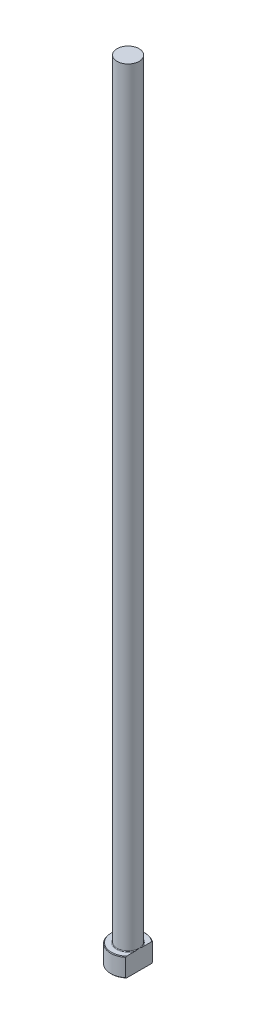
ISO-10303-21;
HEADER;
FILE_DESCRIPTION(('STEP AP214'),'2;1');
FILE_NAME('part.step','',(''),(''),'','','');
FILE_SCHEMA(('AUTOMOTIVE_DESIGN { 1 0 10303 214 1 1 1 1 }'));
ENDSEC;
DATA;
#1=APPLICATION_CONTEXT('core data for automotive mechanical design processes');
#2=APPLICATION_PROTOCOL_DEFINITION('international standard','automotive_design',2000,#1);
#3=PRODUCT_CONTEXT('',#1,'mechanical');
#4=PRODUCT('Part','Part','',(#3));
#5=PRODUCT_RELATED_PRODUCT_CATEGORY('part','',(#4));
#6=PRODUCT_DEFINITION_FORMATION('','',#4);
#7=PRODUCT_DEFINITION_CONTEXT('part definition',#1,'design');
#8=PRODUCT_DEFINITION('design','',#6,#7);
#9=PRODUCT_DEFINITION_SHAPE('','',#8);
#10=(LENGTH_UNIT() NAMED_UNIT(*) SI_UNIT(.MILLI.,.METRE.));
#11=(NAMED_UNIT(*) PLANE_ANGLE_UNIT() SI_UNIT($,.RADIAN.));
#12=(NAMED_UNIT(*) SI_UNIT($,.STERADIAN.) SOLID_ANGLE_UNIT());
#13=UNCERTAINTY_MEASURE_WITH_UNIT(LENGTH_MEASURE(1.E-05),#10,'distance_accuracy_value','');
#14=(GEOMETRIC_REPRESENTATION_CONTEXT(3) GLOBAL_UNCERTAINTY_ASSIGNED_CONTEXT((#13)) GLOBAL_UNIT_ASSIGNED_CONTEXT((#10,
#11,#12)) REPRESENTATION_CONTEXT('',''));
#15=CARTESIAN_POINT('',(0.,0.,0.));
#16=DIRECTION('',(0.,0.,1.));
#17=DIRECTION('',(1.,0.,0.));
#18=AXIS2_PLACEMENT_3D('',#15,#16,#17);
#19=CARTESIAN_POINT('',(0.,0.,0.));
#20=DIRECTION('',(0.,-1.,0.));
#21=DIRECTION('',(0.,0.,-1.));
#22=AXIS2_PLACEMENT_3D('',#19,#20,#21);
#23=PLANE('',#22);
#24=CARTESIAN_POINT('',(0.,0.,0.));
#25=DIRECTION('',(0.,-1.,0.));
#26=DIRECTION('',(0.,0.,-1.));
#27=AXIS2_PLACEMENT_3D('',#24,#25,#26);
#28=CIRCLE('',#27,5.3);
#29=CARTESIAN_POINT('',(3.49999999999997,0.,3.9799497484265));
#30=VERTEX_POINT('',#29);
#31=CARTESIAN_POINT('',(3.49999999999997,0.,-3.9799497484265));
#32=VERTEX_POINT('',#31);
#33=EDGE_CURVE('E98',#30,#32,#28,.T.);
#34=ORIENTED_EDGE('',*,*,#33,.T.);
#35=DIRECTION('',(0.,0.,1.));
#36=VECTOR('',#35,1.);
#37=CARTESIAN_POINT('',(3.49999999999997,0.,4.24264068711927));
#38=LINE('',#37,#36);
#39=EDGE_CURVE('E83',#32,#30,#38,.T.);
#40=ORIENTED_EDGE('',*,*,#39,.T.);
#41=EDGE_LOOP('',(#34,#40));
#42=FACE_BOUND('',#41,.T.);
#43=ADVANCED_FACE('F32',(#42),#23,.T.);
#44=CARTESIAN_POINT('',(0.,259.958771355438,0.));
#45=DIRECTION('',(0.,1.,0.));
#46=DIRECTION('',(0.,0.,1.));
#47=AXIS2_PLACEMENT_3D('',#44,#45,#46);
#48=CYLINDRICAL_SURFACE('',#47,5.49999999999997);
#49=CARTESIAN_POINT('',(0.,5.80000000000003,0.));
#50=DIRECTION('',(0.,1.,0.));
#51=DIRECTION('',(0.,0.,1.));
#52=AXIS2_PLACEMENT_3D('',#49,#50,#51);
#53=CIRCLE('',#52,5.49999999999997);
#54=CARTESIAN_POINT('',(3.49999999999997,5.80000000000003,4.24264068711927));
#55=VERTEX_POINT('',#54);
#56=CARTESIAN_POINT('',(3.49999999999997,5.80000000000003,-4.24264068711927));
#57=VERTEX_POINT('',#56);
#58=EDGE_CURVE('E104',#55,#57,#53,.F.);
#59=ORIENTED_EDGE('',*,*,#58,.T.);
#60=DIRECTION('',(0.,-1.,0.));
#61=VECTOR('',#60,1.);
#62=CARTESIAN_POINT('',(3.49999999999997,250.,-4.24264068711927));
#63=LINE('',#62,#61);
#64=CARTESIAN_POINT('',(3.49999999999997,0.199999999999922,-4.24264068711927));
#65=VERTEX_POINT('',#64);
#66=EDGE_CURVE('E183',#57,#65,#63,.T.);
#67=ORIENTED_EDGE('',*,*,#66,.T.);
#68=CARTESIAN_POINT('',(0.,0.199999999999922,0.));
#69=DIRECTION('',(0.,-1.,0.));
#70=DIRECTION('',(0.,0.,-1.));
#71=AXIS2_PLACEMENT_3D('',#68,#69,#70);
#72=CIRCLE('',#71,5.49999999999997);
#73=CARTESIAN_POINT('',(3.49999999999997,0.199999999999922,4.24264068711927));
#74=VERTEX_POINT('',#73);
#75=EDGE_CURVE('E100',#65,#74,#72,.F.);
#76=ORIENTED_EDGE('',*,*,#75,.T.);
#77=DIRECTION('',(0.,-1.,0.));
#78=VECTOR('',#77,1.);
#79=CARTESIAN_POINT('',(3.49999999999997,250.,4.24264068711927));
#80=LINE('',#79,#78);
#81=EDGE_CURVE('E93',#55,#74,#80,.T.);
#82=ORIENTED_EDGE('',*,*,#81,.F.);
#83=EDGE_LOOP('',(#59,#67,#76,#82));
#84=FACE_BOUND('',#83,.T.);
#85=ADVANCED_FACE('F158',(#84),#48,.T.);
#86=CARTESIAN_POINT('',(-5.49999999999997,6.,0.));
#87=DIRECTION('',(0.,1.,0.));
#88=DIRECTION('',(0.,0.,1.));
#89=AXIS2_PLACEMENT_3D('',#86,#87,#88);
#90=PLANE('',#89);
#91=CARTESIAN_POINT('',(0.,6.,0.));
#92=DIRECTION('',(0.,1.,0.));
#93=DIRECTION('',(0.,0.,1.));
#94=AXIS2_PLACEMENT_3D('',#91,#92,#93);
#95=CIRCLE('',#94,5.29999999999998);
#96=CARTESIAN_POINT('',(3.49999999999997,6.,-3.97994974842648));
#97=VERTEX_POINT('',#96);
#98=CARTESIAN_POINT('',(3.49999999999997,6.,3.97994974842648));
#99=VERTEX_POINT('',#98);
#100=EDGE_CURVE('E178',#97,#99,#95,.T.);
#101=ORIENTED_EDGE('',*,*,#100,.T.);
#102=DIRECTION('',(0.,0.,-1.));
#103=VECTOR('',#102,1.);
#104=CARTESIAN_POINT('',(3.49999999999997,6.,0.));
#105=LINE('',#104,#103);
#106=CARTESIAN_POINT('',(3.49999999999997,5.99999999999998,1.19999999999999));
#107=VERTEX_POINT('',#106);
#108=EDGE_CURVE('E57',#99,#107,#105,.T.);
#109=ORIENTED_EDGE('',*,*,#108,.T.);
#110=CARTESIAN_POINT('',(0.,6.,0.));
#111=DIRECTION('',(0.,1.,0.));
#112=DIRECTION('',(0.,0.,1.));
#113=AXIS2_PLACEMENT_3D('',#110,#111,#112);
#114=CIRCLE('',#113,3.69999999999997);
#115=CARTESIAN_POINT('',(3.49999999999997,5.99999999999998,-1.2));
#116=VERTEX_POINT('',#115);
#117=EDGE_CURVE('E107',#107,#116,#114,.F.);
#118=ORIENTED_EDGE('',*,*,#117,.T.);
#119=EDGE_CURVE('E136',#116,#97,#105,.T.);
#120=ORIENTED_EDGE('',*,*,#119,.T.);
#121=EDGE_LOOP('',(#101,#109,#118,#120));
#122=FACE_BOUND('',#121,.T.);
#123=ADVANCED_FACE('F147',(#122),#90,.T.);
#124=CARTESIAN_POINT('',(0.,6.00000000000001,0.));
#125=DIRECTION('',(0.,-1.,0.));
#126=DIRECTION('',(0.,0.,-1.));
#127=AXIS2_PLACEMENT_3D('',#124,#125,#126);
#128=CONICAL_SURFACE('',#127,5.29999999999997,0.785398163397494);
#129=ORIENTED_EDGE('',*,*,#58,.F.);
#130=CARTESIAN_POINT('',(3.49999999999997,1.33003849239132,9.33542352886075));
#131=CARTESIAN_POINT('',(3.49999999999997,1.46606755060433,9.19014587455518));
#132=CARTESIAN_POINT('',(3.49999999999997,1.60189091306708,9.04467563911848));
#133=CARTESIAN_POINT('',(3.49999999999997,1.87305939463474,8.75328845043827));
#134=CARTESIAN_POINT('',(3.49999999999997,2.00840451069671,8.60737149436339));
#135=CARTESIAN_POINT('',(3.49999999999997,2.41368868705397,8.16878624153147));
#136=CARTESIAN_POINT('',(3.49999999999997,2.68280695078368,7.87535778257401));
#137=CARTESIAN_POINT('',(3.49999999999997,3.22029202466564,7.28335275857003));
#138=CARTESIAN_POINT('',(3.49999999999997,3.4886340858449,6.9847536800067));
#139=CARTESIAN_POINT('',(3.49999999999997,4.02101445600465,6.38381794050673));
#140=CARTESIAN_POINT('',(3.49999999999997,4.28505346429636,6.08148190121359));
#141=CARTESIAN_POINT('',(3.49999999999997,4.76064644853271,5.52540485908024));
#142=CARTESIAN_POINT('',(3.49999999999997,4.97321621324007,5.27253724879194));
#143=CARTESIAN_POINT('',(3.49999999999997,5.28746532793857,4.88936279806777));
#144=CARTESIAN_POINT('',(3.49999999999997,5.39146981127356,4.76096380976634));
#145=CARTESIAN_POINT('',(3.49999999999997,5.59756866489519,4.50264388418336));
#146=CARTESIAN_POINT('',(3.49999999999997,5.69966308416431,4.3727229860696));
#147=CARTESIAN_POINT('',(3.49999999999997,5.9012900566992,4.11132273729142));
#148=CARTESIAN_POINT('',(3.49999999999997,6.00082737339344,3.97984706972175));
#149=CARTESIAN_POINT('',(3.49999999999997,6.19694716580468,3.71471559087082));
#150=CARTESIAN_POINT('',(3.49999999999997,6.29352983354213,3.58105992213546));
#151=CARTESIAN_POINT('',(3.49999999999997,6.48287386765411,3.31118530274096));
#152=CARTESIAN_POINT('',(3.49999999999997,6.57563763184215,3.17496804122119));
#153=CARTESIAN_POINT('',(3.49999999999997,6.75628267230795,2.89934683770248));
#154=CARTESIAN_POINT('',(3.49999999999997,6.84416488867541,2.75994351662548));
#155=CARTESIAN_POINT('',(3.49999999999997,6.99814457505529,2.50290457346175));
#156=CARTESIAN_POINT('',(3.49999999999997,7.06530217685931,2.3859068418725));
#157=CARTESIAN_POINT('',(3.49999999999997,7.19416460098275,2.14890235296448));
#158=CARTESIAN_POINT('',(3.49999999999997,7.25586874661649,2.02889522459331));
#159=CARTESIAN_POINT('',(3.49999999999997,7.37226286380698,1.7856408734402));
#160=CARTESIAN_POINT('',(3.49999999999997,7.42695969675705,1.66239696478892));
#161=CARTESIAN_POINT('',(3.49999999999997,7.52751976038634,1.41233625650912));
#162=CARTESIAN_POINT('',(3.49999999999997,7.57338548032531,1.28552047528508));
#163=CARTESIAN_POINT('',(3.49999999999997,7.64556102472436,1.05555158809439));
#164=CARTESIAN_POINT('',(3.49999999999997,7.67395518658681,0.953056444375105));
#165=CARTESIAN_POINT('',(3.49999999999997,7.72275092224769,0.746191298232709));
#166=CARTESIAN_POINT('',(3.49999999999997,7.7431553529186,0.641821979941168));
#167=CARTESIAN_POINT('',(3.49999999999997,7.77495944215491,0.432002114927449));
#168=CARTESIAN_POINT('',(3.49999999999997,7.78638437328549,0.326555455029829));
#169=CARTESIAN_POINT('',(3.49999999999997,7.79969943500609,0.115055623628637));
#170=CARTESIAN_POINT('',(3.49999999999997,7.80158992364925,0.00900247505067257));
#171=CARTESIAN_POINT('',(3.49999999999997,7.79572329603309,-0.202966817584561));
#172=CARTESIAN_POINT('',(3.49999999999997,7.78795394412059,-0.308882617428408));
#173=CARTESIAN_POINT('',(3.49999999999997,7.76318672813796,-0.519620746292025));
#174=CARTESIAN_POINT('',(3.49999999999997,7.74618811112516,-0.624442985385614));
#175=CARTESIAN_POINT('',(3.49999999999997,7.7037631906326,-0.832676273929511));
#176=CARTESIAN_POINT('',(3.49999999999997,7.67831139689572,-0.936082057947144));
#177=CARTESIAN_POINT('',(3.49999999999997,7.62008719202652,-1.14078653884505));
#178=CARTESIAN_POINT('',(3.49999999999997,7.58731462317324,-1.24208519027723));
#179=CARTESIAN_POINT('',(3.49999999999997,7.50935793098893,-1.45980073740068));
#180=CARTESIAN_POINT('',(3.49999999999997,7.46300722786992,-1.57579699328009));
#181=CARTESIAN_POINT('',(3.49999999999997,7.36341881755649,-1.80480236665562));
#182=CARTESIAN_POINT('',(3.49999999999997,7.31017881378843,-1.91781047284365));
#183=CARTESIAN_POINT('',(3.49999999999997,7.19809800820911,-2.14125149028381));
#184=CARTESIAN_POINT('',(3.49999999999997,7.13924715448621,-2.25167932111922));
#185=CARTESIAN_POINT('',(3.49999999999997,7.01714037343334,-2.47003557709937));
#186=CARTESIAN_POINT('',(3.49999999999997,6.95388506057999,-2.57796434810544));
#187=CARTESIAN_POINT('',(3.49999999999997,6.82298676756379,-2.79303108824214));
#188=CARTESIAN_POINT('',(3.49999999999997,6.75529770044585,-2.90014087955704));
#189=CARTESIAN_POINT('',(3.49999999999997,6.61696954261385,-3.11243359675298));
#190=CARTESIAN_POINT('',(3.49999999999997,6.54633037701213,-3.21761647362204));
#191=CARTESIAN_POINT('',(3.49999999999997,6.33097773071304,-3.53046033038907));
#192=CARTESIAN_POINT('',(3.49999999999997,6.18268185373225,-3.73565296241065));
#193=CARTESIAN_POINT('',(3.49999999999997,5.84686519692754,-4.18490965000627));
#194=CARTESIAN_POINT('',(3.49999999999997,5.6577893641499,-4.42779920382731));
#195=CARTESIAN_POINT('',(3.49999999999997,5.27320376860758,-4.90845921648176));
#196=CARTESIAN_POINT('',(3.49999999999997,5.07769298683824,-5.14622885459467));
#197=CARTESIAN_POINT('',(3.49999999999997,4.68199594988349,-5.61823063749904));
#198=CARTESIAN_POINT('',(3.49999999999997,4.48180526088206,-5.85245905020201));
#199=CARTESIAN_POINT('',(3.49999999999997,4.07816705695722,-6.31809464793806));
#200=CARTESIAN_POINT('',(3.49999999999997,3.87471946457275,-6.54950176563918));
#201=CARTESIAN_POINT('',(3.49999999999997,3.4780510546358,-6.99590528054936));
#202=CARTESIAN_POINT('',(3.49999999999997,3.28497598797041,-7.21103144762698));
#203=CARTESIAN_POINT('',(3.49999999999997,2.8971523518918,-7.63977694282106));
#204=CARTESIAN_POINT('',(3.49999999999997,2.70240374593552,-7.85339623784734));
#205=CARTESIAN_POINT('',(3.49999999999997,2.31198639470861,-8.27898344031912));
#206=CARTESIAN_POINT('',(3.49999999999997,2.11632036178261,-8.49095383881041));
#207=CARTESIAN_POINT('',(3.49999999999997,1.72392141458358,-8.91388826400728));
#208=CARTESIAN_POINT('',(3.49999999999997,1.52718854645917,-9.1248523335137));
#209=CARTESIAN_POINT('',(3.49999999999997,1.33003849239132,-9.33542352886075));
#210=B_SPLINE_CURVE_WITH_KNOTS('',3,(#130,#131,#132,#133,#134,#135,#136,#137,#138,#139,#140,
#141,#142,#143,#144,#145,#146,#147,#148,#149,#150,#151,#152,#153,#154,#155,#156,#157,#158,#159,
#160,#161,#162,#163,#164,#165,#166,#167,#168,#169,#170,#171,#172,#173,#174,#175,#176,#177,#178,
#179,#180,#181,#182,#183,#184,#185,#186,#187,#188,#189,#190,#191,#192,#193,#194,#195,#196,#197,
#198,#199,#200,#201,#202,#203,#204,#205,#206,#207,#208,#209),.UNSPECIFIED.,.F.,.F.,(4,2,2,2,2,2,
2,2,2,2,2,2,2,2,2,2,2,2,2,2,2,2,2,2,2,2,2,2,2,2,2,2,2,2,2,2,2,2,2,4),(0.,0.597063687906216,
1.19413116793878,2.38857142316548,3.59291920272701,4.79706926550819,5.78802649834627,
6.28372320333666,6.77940717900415,7.27408870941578,7.7687380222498,8.26307186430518,
8.7573101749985,9.16190479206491,9.56654954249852,9.97079499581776,10.3749263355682,
10.6937207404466,11.0124010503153,11.3301811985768,11.647949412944,11.9661205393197,
12.2843176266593,12.6034830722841,12.9226553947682,13.2971137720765,13.6716972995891,
14.0469649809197,14.4221804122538,14.8022378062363,15.1823048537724,15.9416042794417,
16.8648705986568,17.7882838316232,18.7126105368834,19.6369592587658,20.5041367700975,
21.37133326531,22.2367481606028,23.1021259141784),.UNSPECIFIED.);
#211=EDGE_CURVE('E135',#55,#99,#210,.T.);
#212=ORIENTED_EDGE('',*,*,#211,.T.);
#213=ORIENTED_EDGE('',*,*,#100,.F.);
#214=EDGE_CURVE('E127',#97,#57,#210,.T.);
#215=ORIENTED_EDGE('',*,*,#214,.T.);
#216=EDGE_LOOP('',(#129,#212,#213,#215));
#217=FACE_BOUND('',#216,.T.);
#218=ADVANCED_FACE('F143',(#217),#128,.T.);
#219=CARTESIAN_POINT('',(0.,0.199999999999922,0.));
#220=DIRECTION('',(0.,1.,0.));
#221=DIRECTION('',(0.,0.,1.));
#222=AXIS2_PLACEMENT_3D('',#219,#220,#221);
#223=CONICAL_SURFACE('',#222,5.49999999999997,0.785398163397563);
#224=ORIENTED_EDGE('',*,*,#75,.F.);
#225=CARTESIAN_POINT('',(3.49999999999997,4.66996150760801,-9.33542352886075));
#226=CARTESIAN_POINT('',(3.49999999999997,4.53393244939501,-9.19014587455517));
#227=CARTESIAN_POINT('',(3.49999999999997,4.39810908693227,-9.04467563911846));
#228=CARTESIAN_POINT('',(3.49999999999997,4.12694060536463,-8.75328845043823));
#229=CARTESIAN_POINT('',(3.49999999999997,3.99159548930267,-8.60737149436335));
#230=CARTESIAN_POINT('',(3.49999999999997,3.58631131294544,-8.1687862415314));
#231=CARTESIAN_POINT('',(3.49999999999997,3.31719304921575,-7.87535778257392));
#232=CARTESIAN_POINT('',(3.49999999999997,2.77970797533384,-7.2833527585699));
#233=CARTESIAN_POINT('',(3.49999999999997,2.5113659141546,-6.98475368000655));
#234=CARTESIAN_POINT('',(3.49999999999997,1.97898554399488,-6.38381794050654));
#235=CARTESIAN_POINT('',(3.49999999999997,1.71494653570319,-6.08148190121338));
#236=CARTESIAN_POINT('',(3.49999999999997,1.23935355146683,-5.52540485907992));
#237=CARTESIAN_POINT('',(3.49999999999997,1.02678378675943,-5.27253724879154));
#238=CARTESIAN_POINT('',(3.49999999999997,0.71253467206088,-4.88936279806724));
#239=CARTESIAN_POINT('',(3.49999999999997,0.608530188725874,-4.76096380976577));
#240=CARTESIAN_POINT('',(3.49999999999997,0.402431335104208,-4.5026438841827));
#241=CARTESIAN_POINT('',(3.49999999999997,0.30033691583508,-4.3727229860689));
#242=CARTESIAN_POINT('',(3.49999999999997,0.0987099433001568,-4.11132273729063));
#243=CARTESIAN_POINT('',(3.49999999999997,-0.000827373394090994,-3.97984706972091));
#244=CARTESIAN_POINT('',(3.49999999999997,-0.196947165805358,-3.71471559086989));
#245=CARTESIAN_POINT('',(3.49999999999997,-0.293529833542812,-3.58105992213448));
#246=CARTESIAN_POINT('',(3.49999999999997,-0.482873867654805,-3.31118530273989));
#247=CARTESIAN_POINT('',(3.49999999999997,-0.575637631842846,-3.17496804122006));
#248=CARTESIAN_POINT('',(3.49999999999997,-0.756282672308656,-2.89934683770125));
#249=CARTESIAN_POINT('',(3.49999999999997,-0.844164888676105,-2.75994351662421));
#250=CARTESIAN_POINT('',(3.49999999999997,-0.998144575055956,-2.5029045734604));
#251=CARTESIAN_POINT('',(3.49999999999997,-1.06530217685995,-2.38590684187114));
#252=CARTESIAN_POINT('',(3.49999999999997,-1.19416460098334,-2.14890235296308));
#253=CARTESIAN_POINT('',(3.49999999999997,-1.25586874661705,-2.0288952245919));
#254=CARTESIAN_POINT('',(3.49999999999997,-1.37226286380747,-1.78564087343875));
#255=CARTESIAN_POINT('',(3.49999999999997,-1.42695969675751,-1.66239696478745));
#256=CARTESIAN_POINT('',(3.49999999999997,-1.52751976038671,-1.41233625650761));
#257=CARTESIAN_POINT('',(3.49999999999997,-1.57338548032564,-1.28552047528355));
#258=CARTESIAN_POINT('',(3.49999999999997,-1.6455610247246,-1.05555158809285));
#259=CARTESIAN_POINT('',(3.49999999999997,-1.67395518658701,-0.953056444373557));
#260=CARTESIAN_POINT('',(3.49999999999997,-1.72275092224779,-0.74619129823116));
#261=CARTESIAN_POINT('',(3.49999999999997,-1.74315535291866,-0.64182197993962));
#262=CARTESIAN_POINT('',(3.49999999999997,-1.77495944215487,-0.432002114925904));
#263=CARTESIAN_POINT('',(3.49999999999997,-1.78638437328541,-0.326555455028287));
#264=CARTESIAN_POINT('',(3.49999999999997,-1.79969943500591,-0.115055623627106));
#265=CARTESIAN_POINT('',(3.49999999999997,-1.80158992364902,-0.00900247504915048));
#266=CARTESIAN_POINT('',(3.49999999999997,-1.79572329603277,0.20296681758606));
#267=CARTESIAN_POINT('',(3.49999999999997,-1.78795394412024,0.308882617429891));
#268=CARTESIAN_POINT('',(3.49999999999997,-1.76318672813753,0.519620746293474));
#269=CARTESIAN_POINT('',(3.49999999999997,-1.74618811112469,0.624442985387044));
#270=CARTESIAN_POINT('',(3.49999999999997,-1.70376319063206,0.832676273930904));
#271=CARTESIAN_POINT('',(3.49999999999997,-1.67831139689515,0.936082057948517));
#272=CARTESIAN_POINT('',(3.49999999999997,-1.62008719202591,1.14078653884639));
#273=CARTESIAN_POINT('',(3.49999999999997,-1.5873146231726,1.24208519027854));
#274=CARTESIAN_POINT('',(3.49999999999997,-1.50935793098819,1.4598007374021));
#275=CARTESIAN_POINT('',(3.49999999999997,-1.4630072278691,1.57579699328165));
#276=CARTESIAN_POINT('',(3.49999999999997,-1.3634188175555,1.80480236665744));
#277=CARTESIAN_POINT('',(3.49999999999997,-1.31017881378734,1.91781047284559));
#278=CARTESIAN_POINT('',(3.49999999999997,-1.19809800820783,2.14125149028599));
#279=CARTESIAN_POINT('',(3.49999999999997,-1.13924715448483,2.25167932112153));
#280=CARTESIAN_POINT('',(3.49999999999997,-1.01714037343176,2.47003557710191));
#281=CARTESIAN_POINT('',(3.49999999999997,-0.953885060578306,2.5779643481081));
#282=CARTESIAN_POINT('',(3.49999999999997,-0.822986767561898,2.79303108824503));
#283=CARTESIAN_POINT('',(3.49999999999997,-0.755297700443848,2.90014087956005));
#284=CARTESIAN_POINT('',(3.49999999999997,-0.61696954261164,3.11243359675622));
#285=CARTESIAN_POINT('',(3.49999999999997,-0.54633037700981,3.21761647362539));
#286=CARTESIAN_POINT('',(3.49999999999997,-0.330977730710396,3.53046033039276));
#287=CARTESIAN_POINT('',(3.49999999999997,-0.182681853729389,3.73565296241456));
#288=CARTESIAN_POINT('',(3.49999999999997,0.153134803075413,4.18490965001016));
#289=CARTESIAN_POINT('',(3.49999999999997,0.342210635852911,4.42779920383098));
#290=CARTESIAN_POINT('',(3.49999999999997,0.726796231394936,4.90845921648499));
#291=CARTESIAN_POINT('',(3.49999999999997,0.922307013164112,5.14622885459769));
#292=CARTESIAN_POINT('',(3.49999999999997,1.31800405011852,5.61823063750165));
#293=CARTESIAN_POINT('',(3.49999999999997,1.51819473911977,5.85245905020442));
#294=CARTESIAN_POINT('',(3.49999999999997,1.92183294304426,6.31809464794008));
#295=CARTESIAN_POINT('',(3.49999999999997,2.12528053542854,6.549501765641));
#296=CARTESIAN_POINT('',(3.49999999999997,2.52194894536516,6.99590528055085));
#297=CARTESIAN_POINT('',(3.49999999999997,2.71502401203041,7.21103144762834));
#298=CARTESIAN_POINT('',(3.49999999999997,3.10284764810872,7.63977694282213));
#299=CARTESIAN_POINT('',(3.49999999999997,3.29759625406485,7.85339623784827));
#300=CARTESIAN_POINT('',(3.49999999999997,3.68801360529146,8.27898344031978));
#301=CARTESIAN_POINT('',(3.49999999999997,3.88367963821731,8.49095383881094));
#302=CARTESIAN_POINT('',(3.49999999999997,4.27607858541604,8.91388826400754));
#303=CARTESIAN_POINT('',(3.49999999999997,4.47281145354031,9.12485233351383));
#304=CARTESIAN_POINT('',(3.49999999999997,4.66996150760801,9.33542352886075));
#305=B_SPLINE_CURVE_WITH_KNOTS('',3,(#225,#226,#227,#228,#229,#230,#231,#232,#233,#234,#235,
#236,#237,#238,#239,#240,#241,#242,#243,#244,#245,#246,#247,#248,#249,#250,#251,#252,#253,#254,
#255,#256,#257,#258,#259,#260,#261,#262,#263,#264,#265,#266,#267,#268,#269,#270,#271,#272,#273,
#274,#275,#276,#277,#278,#279,#280,#281,#282,#283,#284,#285,#286,#287,#288,#289,#290,#291,#292,
#293,#294,#295,#296,#297,#298,#299,#300,#301,#302,#303,#304),.UNSPECIFIED.,.F.,.F.,(4,2,2,2,2,2,
2,2,2,2,2,2,2,2,2,2,2,2,2,2,2,2,2,2,2,2,2,2,2,2,2,2,2,2,2,2,2,2,2,4),(0.,0.597063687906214,
1.19413116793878,2.38857142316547,3.59291920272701,4.7970692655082,5.78802649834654,
6.28372320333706,6.77940717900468,7.27408870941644,7.7687380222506,8.2630718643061,
8.75731017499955,9.16190479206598,9.56654954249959,9.97079499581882,10.3749263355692,
10.6937207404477,11.0124010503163,11.3301811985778,11.647949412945,11.9661205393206,
12.2843176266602,12.603483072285,12.922655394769,13.2971137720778,13.6716972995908,
14.0469649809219,14.4221804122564,14.8022378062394,15.182304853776,15.9416042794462,
16.8648705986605,17.7882838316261,18.7126105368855,19.6369592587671,20.5041367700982,
21.3713332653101,22.2367481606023,23.1021259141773),.UNSPECIFIED.);
#306=EDGE_CURVE('E86',#65,#32,#305,.T.);
#307=ORIENTED_EDGE('',*,*,#306,.T.);
#308=ORIENTED_EDGE('',*,*,#33,.F.);
#309=EDGE_CURVE('E89',#30,#74,#305,.T.);
#310=ORIENTED_EDGE('',*,*,#309,.T.);
#311=EDGE_LOOP('',(#224,#307,#308,#310));
#312=FACE_BOUND('',#311,.T.);
#313=ADVANCED_FACE('F97',(#312),#223,.T.);
#314=CARTESIAN_POINT('',(0.,6.19999999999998,0.));
#315=DIRECTION('',(0.,1.,0.));
#316=DIRECTION('',(0.,0.,1.));
#317=AXIS2_PLACEMENT_3D('',#314,#315,#316);
#318=TOROIDAL_SURFACE('',#317,3.69999999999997,0.2);
#319=CARTESIAN_POINT('',(3.49999999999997,6.19999999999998,0.));
#320=CARTESIAN_POINT('',(3.49999999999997,6.20000050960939,9.98095903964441E-11));
#321=CARTESIAN_POINT('',(3.49999999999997,6.20000101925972,-2.13486753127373E-07));
#322=CARTESIAN_POINT('',(3.49999999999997,6.20000196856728,-7.95759141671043E-07));
#323=CARTESIAN_POINT('',(3.49999999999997,6.20000239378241,-1.17925840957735E-06));
#324=CARTESIAN_POINT('',(3.49999999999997,6.200003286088,-2.10014974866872E-06));
#325=CARTESIAN_POINT('',(3.49999999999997,6.20000373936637,-2.65249911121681E-06));
#326=CARTESIAN_POINT('',(3.49999999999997,6.20000454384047,-3.79112892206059E-06));
#327=CARTESIAN_POINT('',(3.49999999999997,6.20000489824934,-4.37533523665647E-06));
#328=CARTESIAN_POINT('',(3.49999999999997,6.20000623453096,-6.66270063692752E-06));
#329=CARTESIAN_POINT('',(3.49999999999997,6.20000714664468,-8.40961031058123E-06));
#330=CARTESIAN_POINT('',(3.49999999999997,6.20000862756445,-1.18496825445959E-05));
#331=CARTESIAN_POINT('',(3.49999999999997,6.20000922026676,-1.35329549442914E-05));
#332=CARTESIAN_POINT('',(3.49999999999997,6.2000117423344,-2.07268951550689E-05));
#333=CARTESIAN_POINT('',(3.49999999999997,6.20001365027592,-2.6247753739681E-05));
#334=CARTESIAN_POINT('',(3.49999999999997,6.20001642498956,-3.66274574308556E-05));
#335=CARTESIAN_POINT('',(3.49999999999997,6.20001740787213,-4.1454935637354E-05));
#336=CARTESIAN_POINT('',(3.49999999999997,6.20002462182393,-7.75352104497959E-05));
#337=CARTESIAN_POINT('',(3.49999999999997,6.20003014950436,-0.000108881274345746));
#338=CARTESIAN_POINT('',(3.49999999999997,6.2000543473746,-0.000233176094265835));
#339=CARTESIAN_POINT('',(3.49999999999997,6.20007737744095,-0.000325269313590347));
#340=CARTESIAN_POINT('',(3.49999999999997,6.20016742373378,-0.000691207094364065));
#341=CARTESIAN_POINT('',(3.49999999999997,6.20023166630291,-0.00096550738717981));
#342=CARTESIAN_POINT('',(3.49999999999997,6.20048971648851,-0.00205944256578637));
#343=CARTESIAN_POINT('',(3.49999999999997,6.20068705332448,-0.00287847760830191));
#344=CARTESIAN_POINT('',(3.49999999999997,6.20150941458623,-0.00630050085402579));
#345=CARTESIAN_POINT('',(3.49999999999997,6.20212997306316,-0.0089042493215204));
#346=CARTESIAN_POINT('',(3.49999999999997,6.20703918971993,-0.0294912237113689));
#347=CARTESIAN_POINT('',(3.49999999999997,6.21134300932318,-0.0474719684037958));
#348=CARTESIAN_POINT('',(3.49999999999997,6.21975360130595,-0.0827191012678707));
#349=CARTESIAN_POINT('',(3.49999999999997,6.22386136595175,-0.0999852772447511));
#350=CARTESIAN_POINT('',(3.49999999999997,6.23724019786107,-0.156405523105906));
#351=CARTESIAN_POINT('',(3.49999999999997,6.2464585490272,-0.195572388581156));
#352=CARTESIAN_POINT('',(3.49999999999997,6.26203234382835,-0.262828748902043));
#353=CARTESIAN_POINT('',(3.49999999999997,6.26845671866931,-0.290902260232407));
#354=CARTESIAN_POINT('',(3.49999999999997,6.28094671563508,-0.34637973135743));
#355=CARTESIAN_POINT('',(3.49999999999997,6.28701730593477,-0.373782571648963));
#356=CARTESIAN_POINT('',(3.49999999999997,6.30077691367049,-0.437211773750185));
#357=CARTESIAN_POINT('',(3.49999999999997,6.30837892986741,-0.473257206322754));
#358=CARTESIAN_POINT('',(3.49999999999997,6.32309409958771,-0.545736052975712));
#359=CARTESIAN_POINT('',(3.49999999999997,6.33020304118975,-0.582170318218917));
#360=CARTESIAN_POINT('',(3.49999999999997,6.35161649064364,-0.697757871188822));
#361=CARTESIAN_POINT('',(3.49999999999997,6.36463967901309,-0.777158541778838));
#362=CARTESIAN_POINT('',(3.49999999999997,6.38438378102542,-0.927561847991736));
#363=CARTESIAN_POINT('',(3.49999999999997,6.39165512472,-0.998486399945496));
#364=CARTESIAN_POINT('',(3.49999999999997,6.39799897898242,-1.10437287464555));
#365=CARTESIAN_POINT('',(3.49999999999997,6.39936233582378,-1.13919451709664));
#366=CARTESIAN_POINT('',(3.49999999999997,6.40028946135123,-1.20885098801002));
#367=CARTESIAN_POINT('',(3.49999999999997,6.39985418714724,-1.24368579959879));
#368=CARTESIAN_POINT('',(3.49999999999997,6.39686573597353,-1.30963279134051));
#369=CARTESIAN_POINT('',(3.49999999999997,6.3945383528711,-1.34075403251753));
#370=CARTESIAN_POINT('',(3.49999999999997,6.38750048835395,-1.40298456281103));
#371=CARTESIAN_POINT('',(3.49999999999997,6.38277118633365,-1.43409178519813));
#372=CARTESIAN_POINT('',(3.49999999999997,6.37000596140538,-1.49609278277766));
#373=CARTESIAN_POINT('',(3.49999999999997,6.3619304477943,-1.52697933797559));
#374=CARTESIAN_POINT('',(3.49999999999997,6.34614337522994,-1.5719295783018));
#375=CARTESIAN_POINT('',(3.49999999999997,6.34029199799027,-1.58664045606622));
#376=CARTESIAN_POINT('',(3.49999999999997,6.32701491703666,-1.61532155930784));
#377=CARTESIAN_POINT('',(3.49999999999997,6.31959341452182,-1.6292936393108));
#378=CARTESIAN_POINT('',(3.49999999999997,6.30547056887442,-1.6515037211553));
#379=CARTESIAN_POINT('',(3.49999999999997,6.29934759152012,-1.66010585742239));
#380=CARTESIAN_POINT('',(3.49999999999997,6.28595656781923,-1.67637400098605));
#381=CARTESIAN_POINT('',(3.49999999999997,6.27869146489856,-1.68404232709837));
#382=CARTESIAN_POINT('',(3.49999999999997,6.26587375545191,-1.69518467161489));
#383=CARTESIAN_POINT('',(3.49999999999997,6.26073958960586,-1.69913647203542));
#384=CARTESIAN_POINT('',(3.49999999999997,6.24994100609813,-1.7062429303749));
#385=CARTESIAN_POINT('',(3.49999999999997,6.24427723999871,-1.70939855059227));
#386=CARTESIAN_POINT('',(3.49999999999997,6.23351378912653,-1.71418736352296));
#387=CARTESIAN_POINT('',(3.49999999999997,6.22849079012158,-1.71599090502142));
#388=CARTESIAN_POINT('',(3.49999999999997,6.21821361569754,-1.71873268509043));
#389=CARTESIAN_POINT('',(3.49999999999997,6.21295968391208,-1.71967181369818));
#390=CARTESIAN_POINT('',(3.49999999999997,6.2023446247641,-1.72059432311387));
#391=CARTESIAN_POINT('',(3.49999999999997,6.19698314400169,-1.72057373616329));
#392=CARTESIAN_POINT('',(3.49999999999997,6.1863509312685,-1.71956893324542));
#393=CARTESIAN_POINT('',(3.49999999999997,6.18108024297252,-1.71858426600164));
#394=CARTESIAN_POINT('',(3.49999999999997,6.1710686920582,-1.71582968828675));
#395=CARTESIAN_POINT('',(3.49999999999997,6.16631466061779,-1.71410641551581));
#396=CARTESIAN_POINT('',(3.49999999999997,6.15709718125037,-1.71001459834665));
#397=CARTESIAN_POINT('',(3.49999999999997,6.15263381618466,-1.70764587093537));
#398=CARTESIAN_POINT('',(3.49999999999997,6.1411071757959,-1.70060771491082));
#399=CARTESIAN_POINT('',(3.49999999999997,6.13433222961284,-1.69546710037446));
#400=CARTESIAN_POINT('',(3.49999999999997,6.12164557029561,-1.68420869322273));
#401=CARTESIAN_POINT('',(3.49999999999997,6.11573697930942,-1.67808752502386));
#402=CARTESIAN_POINT('',(3.49999999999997,6.10028952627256,-1.66008531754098));
#403=CARTESIAN_POINT('',(3.49999999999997,6.09159238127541,-1.64748936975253));
#404=CARTESIAN_POINT('',(3.49999999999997,6.07604019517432,-1.62125022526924));
#405=CARTESIAN_POINT('',(3.49999999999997,6.06918749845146,-1.60760572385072));
#406=CARTESIAN_POINT('',(3.49999999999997,6.05635908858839,-1.57851190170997));
#407=CARTESIAN_POINT('',(3.49999999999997,6.05050870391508,-1.5630080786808));
#408=CARTESIAN_POINT('',(3.49999999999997,6.04009412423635,-1.53156759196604));
#409=CARTESIAN_POINT('',(3.49999999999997,6.03553147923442,-1.51563043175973));
#410=CARTESIAN_POINT('',(3.49999999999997,6.02331191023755,-1.46712048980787));
#411=CARTESIAN_POINT('',(3.49999999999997,6.0172415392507,-1.43414951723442));
#412=CARTESIAN_POINT('',(3.49999999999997,6.00883071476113,-1.37348993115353));
#413=CARTESIAN_POINT('',(3.49999999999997,6.00603148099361,-1.34585663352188));
#414=CARTESIAN_POINT('',(3.49999999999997,6.00204762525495,-1.29046925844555));
#415=CARTESIAN_POINT('',(3.49999999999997,6.00086336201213,-1.26271515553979));
#416=CARTESIAN_POINT('',(3.49999999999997,5.99925913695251,-1.17922229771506));
#417=CARTESIAN_POINT('',(3.49999999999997,6.00080993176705,-1.12344882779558));
#418=CARTESIAN_POINT('',(3.49999999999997,6.00738569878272,-1.01528124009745));
#419=CARTESIAN_POINT('',(3.49999999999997,6.01221131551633,-0.962872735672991));
#420=CARTESIAN_POINT('',(3.49999999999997,6.02425367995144,-0.858750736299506));
#421=CARTESIAN_POINT('',(3.49999999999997,6.03145152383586,-0.80703500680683));
#422=CARTESIAN_POINT('',(3.49999999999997,6.04786442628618,-0.702500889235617));
#423=CARTESIAN_POINT('',(3.49999999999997,6.05712869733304,-0.649690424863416));
#424=CARTESIAN_POINT('',(3.49999999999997,6.07730630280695,-0.542969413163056));
#425=CARTESIAN_POINT('',(3.49999999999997,6.08825618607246,-0.489065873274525));
#426=CARTESIAN_POINT('',(3.49999999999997,6.10770336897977,-0.397738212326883));
#427=CARTESIAN_POINT('',(3.49999999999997,6.11594150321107,-0.36025805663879));
#428=CARTESIAN_POINT('',(3.49999999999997,6.13268124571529,-0.285797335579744));
#429=CARTESIAN_POINT('',(3.49999999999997,6.14117887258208,-0.248815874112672));
#430=CARTESIAN_POINT('',(3.49999999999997,6.15740628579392,-0.179140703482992));
#431=CARTESIAN_POINT('',(3.49999999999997,6.16511243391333,-0.146441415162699));
#432=CARTESIAN_POINT('',(3.49999999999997,6.18096853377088,-0.0796648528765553));
#433=CARTESIAN_POINT('',(3.49999999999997,6.18912333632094,-0.0455886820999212));
#434=CARTESIAN_POINT('',(3.49999999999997,6.19787118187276,-0.0088990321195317));
#435=CARTESIAN_POINT('',(3.49999999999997,6.19849305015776,-0.00629009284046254));
#436=CARTESIAN_POINT('',(3.49999999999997,6.19931571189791,-0.00286690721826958));
#437=CARTESIAN_POINT('',(3.49999999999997,6.19951207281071,-0.00205190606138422));
#438=CARTESIAN_POINT('',(3.49999999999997,6.19976893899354,-0.000962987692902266));
#439=CARTESIAN_POINT('',(3.49999999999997,6.19983295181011,-0.000689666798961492));
#440=CARTESIAN_POINT('',(3.49999999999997,6.19992272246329,-0.000324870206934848));
#441=CARTESIAN_POINT('',(3.49999999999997,6.19994571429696,-0.000232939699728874));
#442=CARTESIAN_POINT('',(3.49999999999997,6.19996987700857,-0.000108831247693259));
#443=CARTESIAN_POINT('',(3.49999999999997,6.19997540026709,-7.75074377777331E-05));
#444=CARTESIAN_POINT('',(3.49999999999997,6.19998260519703,-4.1449950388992E-05));
#445=CARTESIAN_POINT('',(3.49999999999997,6.19998358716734,-3.66236564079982E-05));
#446=CARTESIAN_POINT('',(3.49999999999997,6.19998635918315,-2.62464272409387E-05));
#447=CARTESIAN_POINT('',(3.49999999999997,6.19998826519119,-2.07267962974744E-05));
#448=CARTESIAN_POINT('',(3.49999999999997,6.19999078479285,-1.35341428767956E-05));
#449=CARTESIAN_POINT('',(3.49999999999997,6.19999137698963,-1.18509584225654E-05));
#450=CARTESIAN_POINT('',(3.49999999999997,6.19999285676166,-8.41098347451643E-06));
#451=CARTESIAN_POINT('',(3.49999999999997,6.19999376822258,-6.66407131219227E-06));
#452=CARTESIAN_POINT('',(3.49999999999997,6.19999510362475,-4.37661197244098E-06));
#453=CARTESIAN_POINT('',(3.49999999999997,6.19999545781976,-3.79235336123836E-06));
#454=CARTESIAN_POINT('',(3.49999999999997,6.19999626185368,-2.65358035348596E-06));
#455=CARTESIAN_POINT('',(3.49999999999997,6.19999671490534,-2.10113841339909E-06));
#456=CARTESIAN_POINT('',(3.49999999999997,6.19999760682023,-1.18003192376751E-06));
#457=CARTESIAN_POINT('',(3.49999999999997,6.19999803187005,-7.96418775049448E-07));
#458=CARTESIAN_POINT('',(3.49999999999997,6.1999989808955,-2.1385519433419E-07));
#459=CARTESIAN_POINT('',(3.49999999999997,6.19999949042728,-9.98024010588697E-11));
#460=CARTESIAN_POINT('',(3.49999999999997,6.19999999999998,0.));
#461=B_SPLINE_CURVE_WITH_KNOTS('',3,(#319,#320,#321,#322,#323,#324,#325,#326,#327,#328,#329,
#330,#331,#332,#333,#334,#335,#336,#337,#338,#339,#340,#341,#342,#343,#344,#345,#346,#347,#348,
#349,#350,#351,#352,#353,#354,#355,#356,#357,#358,#359,#360,#361,#362,#363,#364,#365,#366,#367,
#368,#369,#370,#371,#372,#373,#374,#375,#376,#377,#378,#379,#380,#381,#382,#383,#384,#385,#386,
#387,#388,#389,#390,#391,#392,#393,#394,#395,#396,#397,#398,#399,#400,#401,#402,#403,#404,#405,
#406,#407,#408,#409,#410,#411,#412,#413,#414,#415,#416,#417,#418,#419,#420,#421,#422,#423,#424,
#425,#426,#427,#428,#429,#430,#431,#432,#433,#434,#435,#436,#437,#438,#439,#440,#441,#442,#443,
#444,#445,#446,#447,#448,#449,#450,#451,#452,#453,#454,#455,#456,#457,#458,#459,#460),
.UNSPECIFIED.,.T.,.F.,(4,2,2,2,2,2,2,2,2,2,2,2,2,2,2,2,2,2,2,2,2,2,2,2,2,2,2,2,2,2,2,2,2,2,2,2,
2,2,2,2,2,2,2,2,2,2,2,2,2,2,2,2,2,2,2,2,2,2,2,2,2,2,2,2,2,2,2,2,2,2,4),(0.,1.54778898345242E-06,
3.27068843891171E-06,5.40032131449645E-06,7.44938881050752E-06,1.33412903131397E-05,
1.86900585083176E-05,3.61865042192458E-05,5.09488025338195E-05,0.000146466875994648,
0.000431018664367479,0.00127643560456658,0.00380354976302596,0.0118339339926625,
0.067298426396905,0.120543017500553,0.241253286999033,0.327650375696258,0.411851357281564,
0.522362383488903,0.633723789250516,0.875007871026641,1.0886971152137,1.19320699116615,
1.29766126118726,1.39121331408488,1.48550998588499,1.58095571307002,1.62839133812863,
1.67570160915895,1.70731126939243,1.73884076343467,1.75822424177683,1.77758417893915,
1.79352969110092,1.80945876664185,1.82545370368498,1.84145613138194,1.85657000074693,
1.87168815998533,1.89705349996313,1.92250811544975,1.96816999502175,2.01388964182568,
2.06352392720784,2.11321770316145,2.21356505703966,2.29684564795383,2.380144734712,
2.54733140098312,2.70515844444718,2.86175703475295,3.02258329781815,3.1875822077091,
3.30270498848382,3.41653913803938,3.51732480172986,3.62243689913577,3.63048332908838,
3.63299799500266,3.63384039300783,3.63412444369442,3.63421989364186,3.63423465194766,
3.63425214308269,3.63425749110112,3.63426338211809,3.63426543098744,3.63426756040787,
3.63426928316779,3.63427083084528),.UNSPECIFIED.);
#462=CARTESIAN_POINT('',(3.49999999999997,6.19999999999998,0.));
#463=VERTEX_POINT('',#462);
#464=EDGE_CURVE('E11',#116,#463,#461,.T.);
#465=ORIENTED_EDGE('',*,*,#464,.F.);
#466=ORIENTED_EDGE('',*,*,#117,.F.);
#467=CARTESIAN_POINT('',(3.49999999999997,6.19999999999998,0.));
#468=CARTESIAN_POINT('',(3.49999999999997,6.19999949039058,-9.9809564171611E-11));
#469=CARTESIAN_POINT('',(3.49999999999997,6.19999898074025,2.13486753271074E-07));
#470=CARTESIAN_POINT('',(3.49999999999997,6.19999803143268,7.95759141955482E-07));
#471=CARTESIAN_POINT('',(3.49999999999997,6.19999760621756,1.17925840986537E-06));
#472=CARTESIAN_POINT('',(3.49999999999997,6.19999671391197,2.10014974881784E-06));
#473=CARTESIAN_POINT('',(3.49999999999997,6.1999962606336,2.65249911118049E-06));
#474=CARTESIAN_POINT('',(3.49999999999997,6.1999954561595,3.79112892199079E-06));
#475=CARTESIAN_POINT('',(3.49999999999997,6.19999510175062,4.37533523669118E-06));
#476=CARTESIAN_POINT('',(3.49999999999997,6.199993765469,6.66270063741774E-06));
#477=CARTESIAN_POINT('',(3.49999999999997,6.19999285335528,8.40961031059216E-06));
#478=CARTESIAN_POINT('',(3.49999999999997,6.19999137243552,1.18496825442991E-05));
#479=CARTESIAN_POINT('',(3.49999999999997,6.19999077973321,1.35329549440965E-05));
#480=CARTESIAN_POINT('',(3.49999999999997,6.19998825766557,2.07268951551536E-05));
#481=CARTESIAN_POINT('',(3.49999999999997,6.19998634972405,2.62477537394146E-05));
#482=CARTESIAN_POINT('',(3.49999999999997,6.19998357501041,3.66274574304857E-05));
#483=CARTESIAN_POINT('',(3.49999999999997,6.19998259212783,4.14549356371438E-05));
#484=CARTESIAN_POINT('',(3.49999999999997,6.19997537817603,7.75352104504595E-05));
#485=CARTESIAN_POINT('',(3.49999999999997,6.19996985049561,0.000108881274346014));
#486=CARTESIAN_POINT('',(3.49999999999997,6.19994565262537,0.000233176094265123));
#487=CARTESIAN_POINT('',(3.49999999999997,6.19992262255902,0.000325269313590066));
#488=CARTESIAN_POINT('',(3.49999999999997,6.19983257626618,0.000691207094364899));
#489=CARTESIAN_POINT('',(3.49999999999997,6.19976833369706,0.000965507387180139));
#490=CARTESIAN_POINT('',(3.49999999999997,6.19951028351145,0.00205944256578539));
#491=CARTESIAN_POINT('',(3.49999999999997,6.19931294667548,0.00287847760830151));
#492=CARTESIAN_POINT('',(3.49999999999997,6.19849058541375,0.00630050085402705));
#493=CARTESIAN_POINT('',(3.49999999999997,6.19787002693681,0.00890424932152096));
#494=CARTESIAN_POINT('',(3.49999999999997,6.19296081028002,0.0294912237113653));
#495=CARTESIAN_POINT('',(3.49999999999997,6.18865699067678,0.0474719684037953));
#496=CARTESIAN_POINT('',(3.49999999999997,6.18024639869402,0.0827191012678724));
#497=CARTESIAN_POINT('',(3.49999999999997,6.17613863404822,0.0999852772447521));
#498=CARTESIAN_POINT('',(3.49999999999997,6.16275980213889,0.156405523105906));
#499=CARTESIAN_POINT('',(3.49999999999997,6.15354145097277,0.195572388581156));
#500=CARTESIAN_POINT('',(3.49999999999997,6.13796765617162,0.262828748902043));
#501=CARTESIAN_POINT('',(3.49999999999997,6.13154328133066,0.290902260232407));
#502=CARTESIAN_POINT('',(3.49999999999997,6.11905328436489,0.34637973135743));
#503=CARTESIAN_POINT('',(3.49999999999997,6.1129826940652,0.373782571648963));
#504=CARTESIAN_POINT('',(3.49999999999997,6.09922308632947,0.437211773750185));
#505=CARTESIAN_POINT('',(3.49999999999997,6.09162107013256,0.473257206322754));
#506=CARTESIAN_POINT('',(3.49999999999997,6.07690590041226,0.545736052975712));
#507=CARTESIAN_POINT('',(3.49999999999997,6.06979695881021,0.582170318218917));
#508=CARTESIAN_POINT('',(3.49999999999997,6.04838350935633,0.697757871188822));
#509=CARTESIAN_POINT('',(3.49999999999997,6.03536032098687,0.777158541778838));
#510=CARTESIAN_POINT('',(3.49999999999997,6.01561621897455,0.927561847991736));
#511=CARTESIAN_POINT('',(3.49999999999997,6.00834487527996,0.998486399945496));
#512=CARTESIAN_POINT('',(3.49999999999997,6.00200102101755,1.10437287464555));
#513=CARTESIAN_POINT('',(3.49999999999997,6.00063766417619,1.13919451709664));
#514=CARTESIAN_POINT('',(3.49999999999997,5.99971053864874,1.20885098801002));
#515=CARTESIAN_POINT('',(3.49999999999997,6.00014581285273,1.24368579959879));
#516=CARTESIAN_POINT('',(3.49999999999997,6.00313426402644,1.30963279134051));
#517=CARTESIAN_POINT('',(3.49999999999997,6.00546164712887,1.34075403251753));
#518=CARTESIAN_POINT('',(3.49999999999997,6.01249951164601,1.40298456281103));
#519=CARTESIAN_POINT('',(3.49999999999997,6.01722881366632,1.43409178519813));
#520=CARTESIAN_POINT('',(3.49999999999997,6.02999403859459,1.49609278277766));
#521=CARTESIAN_POINT('',(3.49999999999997,6.03806955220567,1.52697933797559));
#522=CARTESIAN_POINT('',(3.49999999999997,6.05385662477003,1.5719295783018));
#523=CARTESIAN_POINT('',(3.49999999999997,6.0597080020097,1.58664045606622));
#524=CARTESIAN_POINT('',(3.49999999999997,6.07298508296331,1.61532155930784));
#525=CARTESIAN_POINT('',(3.49999999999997,6.08040658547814,1.6292936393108));
#526=CARTESIAN_POINT('',(3.49999999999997,6.09452943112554,1.6515037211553));
#527=CARTESIAN_POINT('',(3.49999999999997,6.10065240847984,1.66010585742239));
#528=CARTESIAN_POINT('',(3.49999999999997,6.11404343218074,1.67637400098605));
#529=CARTESIAN_POINT('',(3.49999999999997,6.1213085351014,1.68404232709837));
#530=CARTESIAN_POINT('',(3.49999999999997,6.13412624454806,1.69518467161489));
#531=CARTESIAN_POINT('',(3.49999999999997,6.13926041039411,1.69913647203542));
#532=CARTESIAN_POINT('',(3.49999999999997,6.15005899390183,1.7062429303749));
#533=CARTESIAN_POINT('',(3.49999999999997,6.15572276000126,1.70939855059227));
#534=CARTESIAN_POINT('',(3.49999999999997,6.16648621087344,1.71418736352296));
#535=CARTESIAN_POINT('',(3.49999999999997,6.17150920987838,1.71599090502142));
#536=CARTESIAN_POINT('',(3.49999999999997,6.18178638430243,1.71873268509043));
#537=CARTESIAN_POINT('',(3.49999999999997,6.18704031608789,1.71967181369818));
#538=CARTESIAN_POINT('',(3.49999999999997,6.19765537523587,1.72059432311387));
#539=CARTESIAN_POINT('',(3.49999999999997,6.20301685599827,1.72057373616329));
#540=CARTESIAN_POINT('',(3.49999999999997,6.21364906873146,1.71956893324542));
#541=CARTESIAN_POINT('',(3.49999999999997,6.21891975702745,1.71858426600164));
#542=CARTESIAN_POINT('',(3.49999999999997,6.22893130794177,1.71582968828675));
#543=CARTESIAN_POINT('',(3.49999999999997,6.23368533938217,1.71410641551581));
#544=CARTESIAN_POINT('',(3.49999999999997,6.2429028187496,1.71001459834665));
#545=CARTESIAN_POINT('',(3.49999999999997,6.2473661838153,1.70764587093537));
#546=CARTESIAN_POINT('',(3.49999999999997,6.25889282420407,1.70060771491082));
#547=CARTESIAN_POINT('',(3.49999999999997,6.26566777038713,1.69546710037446));
#548=CARTESIAN_POINT('',(3.49999999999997,6.27835442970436,1.68420869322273));
#549=CARTESIAN_POINT('',(3.49999999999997,6.28426302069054,1.67808752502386));
#550=CARTESIAN_POINT('',(3.49999999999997,6.2997104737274,1.66008531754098));
#551=CARTESIAN_POINT('',(3.49999999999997,6.30840761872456,1.64748936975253));
#552=CARTESIAN_POINT('',(3.49999999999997,6.32395980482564,1.62125022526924));
#553=CARTESIAN_POINT('',(3.49999999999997,6.33081250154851,1.60760572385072));
#554=CARTESIAN_POINT('',(3.49999999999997,6.34364091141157,1.57851190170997));
#555=CARTESIAN_POINT('',(3.49999999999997,6.34949129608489,1.5630080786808));
#556=CARTESIAN_POINT('',(3.49999999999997,6.35990587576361,1.53156759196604));
#557=CARTESIAN_POINT('',(3.49999999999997,6.36446852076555,1.51563043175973));
#558=CARTESIAN_POINT('',(3.49999999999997,6.37668808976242,1.46712048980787));
#559=CARTESIAN_POINT('',(3.49999999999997,6.38275846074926,1.43414951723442));
#560=CARTESIAN_POINT('',(3.49999999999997,6.39116928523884,1.37348993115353));
#561=CARTESIAN_POINT('',(3.49999999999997,6.39396851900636,1.34585663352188));
#562=CARTESIAN_POINT('',(3.49999999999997,6.39795237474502,1.29046925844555));
#563=CARTESIAN_POINT('',(3.49999999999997,6.39913663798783,1.26271515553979));
#564=CARTESIAN_POINT('',(3.49999999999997,6.40074086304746,1.17922229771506));
#565=CARTESIAN_POINT('',(3.49999999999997,6.39919006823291,1.12344882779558));
#566=CARTESIAN_POINT('',(3.49999999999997,6.39261430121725,1.01528124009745));
#567=CARTESIAN_POINT('',(3.49999999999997,6.38778868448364,0.962872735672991));
#568=CARTESIAN_POINT('',(3.49999999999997,6.37574632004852,0.858750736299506));
#569=CARTESIAN_POINT('',(3.49999999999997,6.3685484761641,0.80703500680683));
#570=CARTESIAN_POINT('',(3.49999999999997,6.35213557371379,0.702500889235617));
#571=CARTESIAN_POINT('',(3.49999999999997,6.34287130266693,0.649690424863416));
#572=CARTESIAN_POINT('',(3.49999999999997,6.32269369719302,0.542969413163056));
#573=CARTESIAN_POINT('',(3.49999999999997,6.3117438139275,0.489065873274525));
#574=CARTESIAN_POINT('',(3.49999999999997,6.29229663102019,0.397738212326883));
#575=CARTESIAN_POINT('',(3.49999999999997,6.2840584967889,0.36025805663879));
#576=CARTESIAN_POINT('',(3.49999999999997,6.26731875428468,0.285797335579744));
#577=CARTESIAN_POINT('',(3.49999999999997,6.25882112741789,0.248815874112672));
#578=CARTESIAN_POINT('',(3.49999999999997,6.24259371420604,0.179140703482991));
#579=CARTESIAN_POINT('',(3.49999999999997,6.23488756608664,0.146441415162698));
#580=CARTESIAN_POINT('',(3.49999999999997,6.21903146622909,0.0796648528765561));
#581=CARTESIAN_POINT('',(3.49999999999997,6.21087666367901,0.0455886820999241));
#582=CARTESIAN_POINT('',(3.49999999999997,6.20212881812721,0.00889903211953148));
#583=CARTESIAN_POINT('',(3.49999999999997,6.20150694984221,0.00629009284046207));
#584=CARTESIAN_POINT('',(3.49999999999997,6.20068428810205,0.00286690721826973));
#585=CARTESIAN_POINT('',(3.49999999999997,6.20048792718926,0.00205190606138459));
#586=CARTESIAN_POINT('',(3.49999999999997,6.20023106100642,0.000962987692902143));
#587=CARTESIAN_POINT('',(3.49999999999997,6.20016704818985,0.000689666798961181));
#588=CARTESIAN_POINT('',(3.49999999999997,6.20007727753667,0.000324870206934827));
#589=CARTESIAN_POINT('',(3.49999999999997,6.20005428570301,0.000232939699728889));
#590=CARTESIAN_POINT('',(3.49999999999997,6.20003012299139,0.000108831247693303));
#591=CARTESIAN_POINT('',(3.49999999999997,6.20002459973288,7.75074377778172E-05));
#592=CARTESIAN_POINT('',(3.49999999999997,6.20001739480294,4.14499503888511E-05));
#593=CARTESIAN_POINT('',(3.49999999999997,6.20001641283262,3.66236564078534E-05));
#594=CARTESIAN_POINT('',(3.49999999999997,6.20001364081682,2.62464272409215E-05));
#595=CARTESIAN_POINT('',(3.49999999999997,6.20001173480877,2.07267962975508E-05));
#596=CARTESIAN_POINT('',(3.49999999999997,6.20000921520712,1.35341428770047E-05));
#597=CARTESIAN_POINT('',(3.49999999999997,6.20000862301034,1.18509584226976E-05));
#598=CARTESIAN_POINT('',(3.49999999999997,6.20000714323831,8.41098347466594E-06));
#599=CARTESIAN_POINT('',(3.49999999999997,6.20000623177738,6.66407131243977E-06));
#600=CARTESIAN_POINT('',(3.49999999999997,6.20000489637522,4.37661197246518E-06));
#601=CARTESIAN_POINT('',(3.49999999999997,6.20000454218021,3.79235336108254E-06));
#602=CARTESIAN_POINT('',(3.49999999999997,6.20000373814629,2.65358035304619E-06));
#603=CARTESIAN_POINT('',(3.49999999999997,6.20000328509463,2.10113841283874E-06));
#604=CARTESIAN_POINT('',(3.49999999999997,6.20000239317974,1.18003192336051E-06));
#605=CARTESIAN_POINT('',(3.49999999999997,6.20000196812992,7.96418774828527E-07));
#606=CARTESIAN_POINT('',(3.49999999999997,6.20000101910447,2.13855194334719E-07));
#607=CARTESIAN_POINT('',(3.49999999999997,6.20000050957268,9.98023748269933E-11));
#608=CARTESIAN_POINT('',(3.49999999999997,6.19999999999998,0.));
#609=B_SPLINE_CURVE_WITH_KNOTS('',3,(#467,#468,#469,#470,#471,#472,#473,#474,#475,#476,#477,
#478,#479,#480,#481,#482,#483,#484,#485,#486,#487,#488,#489,#490,#491,#492,#493,#494,#495,#496,
#497,#498,#499,#500,#501,#502,#503,#504,#505,#506,#507,#508,#509,#510,#511,#512,#513,#514,#515,
#516,#517,#518,#519,#520,#521,#522,#523,#524,#525,#526,#527,#528,#529,#530,#531,#532,#533,#534,
#535,#536,#537,#538,#539,#540,#541,#542,#543,#544,#545,#546,#547,#548,#549,#550,#551,#552,#553,
#554,#555,#556,#557,#558,#559,#560,#561,#562,#563,#564,#565,#566,#567,#568,#569,#570,#571,#572,
#573,#574,#575,#576,#577,#578,#579,#580,#581,#582,#583,#584,#585,#586,#587,#588,#589,#590,#591,
#592,#593,#594,#595,#596,#597,#598,#599,#600,#601,#602,#603,#604,#605,#606,#607,#608),
.UNSPECIFIED.,.T.,.F.,(4,2,2,2,2,2,2,2,2,2,2,2,2,2,2,2,2,2,2,2,2,2,2,2,2,2,2,2,2,2,2,2,2,2,2,2,
2,2,2,2,2,2,2,2,2,2,2,2,2,2,2,2,2,2,2,2,2,2,2,2,2,2,2,2,2,2,2,2,2,2,4),(0.,1.54778898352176E-06,
3.27068843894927E-06,5.40032131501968E-06,7.44938881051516E-06,1.33412903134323E-05,
1.86900585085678E-05,3.61865042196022E-05,5.09488025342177E-05,0.000146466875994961,
0.000431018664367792,0.0012764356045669,0.00380354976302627,0.0118339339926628,
0.067298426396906,0.120543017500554,0.241253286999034,0.327650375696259,0.411851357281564,
0.522362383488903,0.633723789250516,0.875007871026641,1.0886971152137,1.19320699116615,
1.29766126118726,1.39121331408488,1.48550998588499,1.58095571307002,1.62839133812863,
1.67570160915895,1.70731126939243,1.73884076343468,1.75822424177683,1.77758417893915,
1.79352969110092,1.80945876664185,1.82545370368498,1.84145613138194,1.85657000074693,
1.87168815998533,1.89705349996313,1.92250811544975,1.96816999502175,2.01388964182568,
2.06352392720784,2.11321770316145,2.21356505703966,2.29684564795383,2.380144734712,
2.54733140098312,2.70515844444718,2.86175703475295,3.02258329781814,3.1875822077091,
3.30270498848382,3.41653913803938,3.51732480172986,3.62243689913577,3.63048332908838,
3.63299799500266,3.63384039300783,3.63412444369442,3.63421989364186,3.63423465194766,
3.63425214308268,3.63425749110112,3.63426338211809,3.63426543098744,3.63426756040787,
3.63426928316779,3.63427083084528),.UNSPECIFIED.);
#610=EDGE_CURVE('E46',#463,#107,#609,.T.);
#611=ORIENTED_EDGE('',*,*,#610,.F.);
#612=CARTESIAN_POINT('',(0.,6.19999999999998,0.));
#613=DIRECTION('',(0.,1.,0.));
#614=DIRECTION('',(0.,0.,1.));
#615=AXIS2_PLACEMENT_3D('',#612,#613,#614);
#616=CIRCLE('',#615,3.49999999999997);
#617=EDGE_CURVE('E103',#463,#463,#616,.T.);
#618=ORIENTED_EDGE('',*,*,#617,.F.);
#619=EDGE_LOOP('',(#465,#466,#611,#618));
#620=FACE_BOUND('',#619,.T.);
#621=ADVANCED_FACE('F34',(#620),#318,.F.);
#622=CARTESIAN_POINT('',(0.,259.958771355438,0.));
#623=DIRECTION('',(0.,1.,0.));
#624=DIRECTION('',(0.,0.,1.));
#625=AXIS2_PLACEMENT_3D('',#622,#623,#624);
#626=CYLINDRICAL_SURFACE('',#625,3.49999999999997);
#627=ORIENTED_EDGE('',*,*,#617,.T.);
#628=EDGE_LOOP('',(#627));
#629=FACE_BOUND('',#628,.T.);
#630=CARTESIAN_POINT('',(0.,250.,0.));
#631=DIRECTION('',(0.,1.,0.));
#632=DIRECTION('',(0.,0.,1.));
#633=AXIS2_PLACEMENT_3D('',#630,#631,#632);
#634=CIRCLE('',#633,3.49999999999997);
#635=CARTESIAN_POINT('',(0.,250.,3.49999999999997));
#636=VERTEX_POINT('',#635);
#637=EDGE_CURVE('E101',#636,#636,#634,.T.);
#638=ORIENTED_EDGE('',*,*,#637,.F.);
#639=EDGE_LOOP('',(#638));
#640=FACE_BOUND('',#639,.T.);
#641=ADVANCED_FACE('F155',(#629,#640),#626,.T.);
#642=CARTESIAN_POINT('',(-3.49999999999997,250.,0.));
#643=DIRECTION('',(0.,1.,0.));
#644=DIRECTION('',(0.,0.,1.));
#645=AXIS2_PLACEMENT_3D('',#642,#643,#644);
#646=PLANE('',#645);
#647=ORIENTED_EDGE('',*,*,#637,.T.);
#648=EDGE_LOOP('',(#647));
#649=FACE_BOUND('',#648,.T.);
#650=ADVANCED_FACE('F121',(#649),#646,.T.);
#651=CARTESIAN_POINT('',(3.49999999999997,250.,4.24264068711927));
#652=DIRECTION('',(1.,0.,0.));
#653=DIRECTION('',(0.,0.,-1.));
#654=AXIS2_PLACEMENT_3D('',#651,#652,#653);
#655=PLANE('',#654);
#656=ORIENTED_EDGE('',*,*,#66,.F.);
#657=ORIENTED_EDGE('',*,*,#214,.F.);
#658=ORIENTED_EDGE('',*,*,#119,.F.);
#659=ORIENTED_EDGE('',*,*,#464,.T.);
#660=ORIENTED_EDGE('',*,*,#610,.T.);
#661=ORIENTED_EDGE('',*,*,#108,.F.);
#662=ORIENTED_EDGE('',*,*,#211,.F.);
#663=ORIENTED_EDGE('',*,*,#81,.T.);
#664=ORIENTED_EDGE('',*,*,#309,.F.);
#665=ORIENTED_EDGE('',*,*,#39,.F.);
#666=ORIENTED_EDGE('',*,*,#306,.F.);
#667=EDGE_LOOP('',(#656,#657,#658,#659,#660,#661,#662,#663,#664,#665,#666));
#668=FACE_BOUND('',#667,.T.);
#669=ADVANCED_FACE('F85',(#668),#655,.T.);
#670=CLOSED_SHELL('',(#43,#85,#123,#218,#313,#621,#641,#650,#669));
#671=MANIFOLD_SOLID_BREP('B2',#670);
#672=ADVANCED_BREP_SHAPE_REPRESENTATION('',(#18,#671),#14);
#673=SHAPE_DEFINITION_REPRESENTATION(#9,#672);
ENDSEC;
END-ISO-10303-21;
